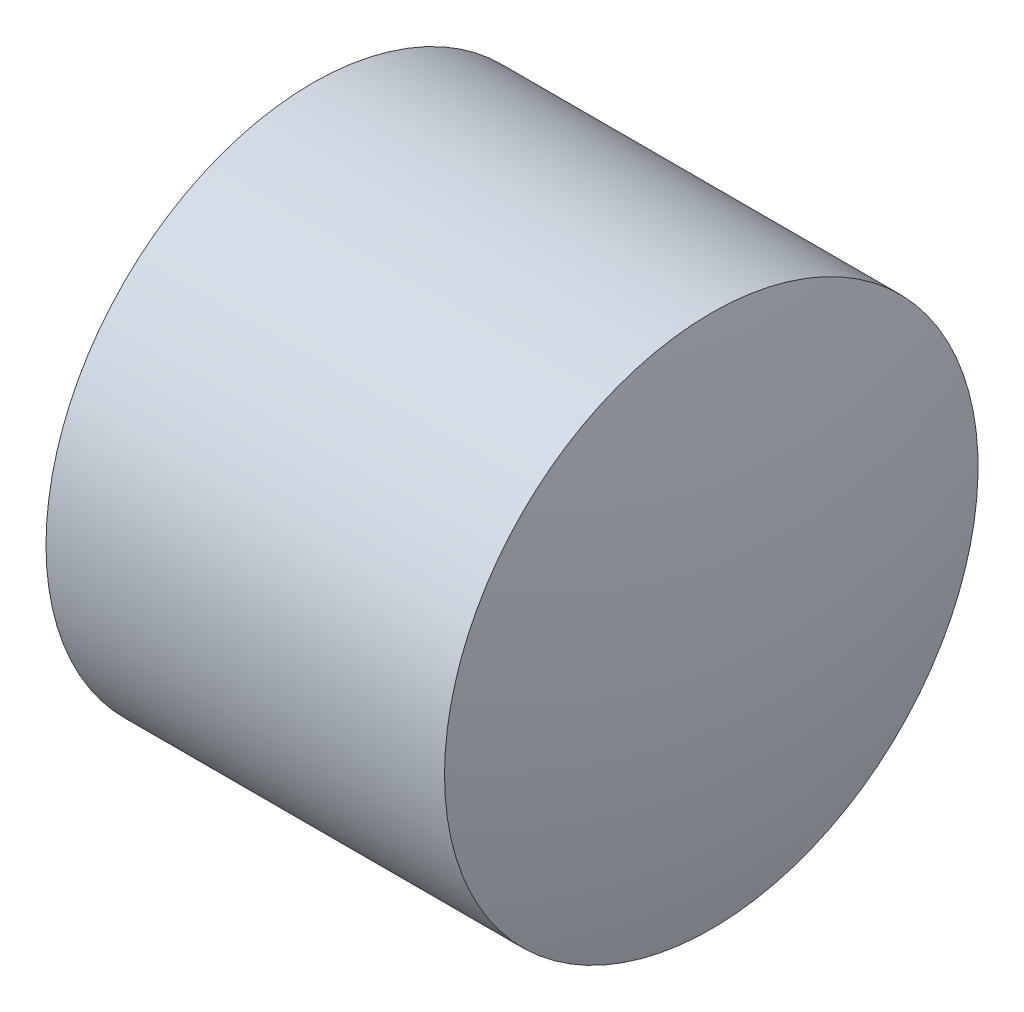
ISO-10303-21;
HEADER;
FILE_DESCRIPTION(('STEP AP214'),'2;1');
FILE_NAME('part.step','',(''),(''),'','','');
FILE_SCHEMA(('AUTOMOTIVE_DESIGN { 1 0 10303 214 1 1 1 1 }'));
ENDSEC;
DATA;
#1=APPLICATION_CONTEXT('core data for automotive mechanical design processes');
#2=APPLICATION_PROTOCOL_DEFINITION('international standard','automotive_design',2000,#1);
#3=PRODUCT_CONTEXT('',#1,'mechanical');
#4=PRODUCT('Part','Part','',(#3));
#5=PRODUCT_RELATED_PRODUCT_CATEGORY('part','',(#4));
#6=PRODUCT_DEFINITION_FORMATION('','',#4);
#7=PRODUCT_DEFINITION_CONTEXT('part definition',#1,'design');
#8=PRODUCT_DEFINITION('design','',#6,#7);
#9=PRODUCT_DEFINITION_SHAPE('','',#8);
#10=(LENGTH_UNIT() NAMED_UNIT(*) SI_UNIT(.MILLI.,.METRE.));
#11=(NAMED_UNIT(*) PLANE_ANGLE_UNIT() SI_UNIT($,.RADIAN.));
#12=(NAMED_UNIT(*) SI_UNIT($,.STERADIAN.) SOLID_ANGLE_UNIT());
#13=UNCERTAINTY_MEASURE_WITH_UNIT(LENGTH_MEASURE(1.E-05),#10,'distance_accuracy_value','');
#14=(GEOMETRIC_REPRESENTATION_CONTEXT(3) GLOBAL_UNCERTAINTY_ASSIGNED_CONTEXT((#13)) GLOBAL_UNIT_ASSIGNED_CONTEXT((#10,
#11,#12)) REPRESENTATION_CONTEXT('',''));
#15=CARTESIAN_POINT('',(0.,0.,0.));
#16=DIRECTION('',(0.,0.,1.));
#17=DIRECTION('',(1.,0.,0.));
#18=AXIS2_PLACEMENT_3D('',#15,#16,#17);
#19=CARTESIAN_POINT('',(24.8875,0.,8.));
#20=DIRECTION('',(-1.,0.,0.));
#21=DIRECTION('',(0.,1.,0.));
#22=AXIS2_PLACEMENT_3D('',#19,#20,#21);
#23=SPHERICAL_SURFACE('',#22,6.0525);
#24=CARTESIAN_POINT('',(19.3754444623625,0.,8.));
#25=DIRECTION('',(-1.,0.,0.));
#26=DIRECTION('',(0.,0.,1.));
#27=AXIS2_PLACEMENT_3D('',#24,#25,#26);
#28=CIRCLE('',#27,2.5);
#29=CARTESIAN_POINT('',(19.3754444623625,0.,10.5));
#30=VERTEX_POINT('',#29);
#31=EDGE_CURVE('E36',#30,#30,#28,.T.);
#32=ORIENTED_EDGE('',*,*,#31,.T.);
#33=EDGE_LOOP('',(#32));
#34=FACE_BOUND('',#33,.T.);
#35=ADVANCED_FACE('F30',(#34),#23,.T.);
#36=CARTESIAN_POINT('',(13.654,0.,8.));
#37=DIRECTION('',(-1.,0.,0.));
#38=DIRECTION('',(0.,1.,0.));
#39=AXIS2_PLACEMENT_3D('',#36,#37,#38);
#40=SPHERICAL_SURFACE('',#39,9.781);
#41=CARTESIAN_POINT('',(23.1101070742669,0.,8.));
#42=DIRECTION('',(-1.,0.,0.));
#43=DIRECTION('',(0.,0.,1.));
#44=AXIS2_PLACEMENT_3D('',#41,#42,#43);
#45=CIRCLE('',#44,2.5);
#46=CARTESIAN_POINT('',(23.1101070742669,0.,10.5));
#47=VERTEX_POINT('',#46);
#48=EDGE_CURVE('E10',#47,#47,#45,.T.);
#49=ORIENTED_EDGE('',*,*,#48,.F.);
#50=EDGE_LOOP('',(#49));
#51=FACE_BOUND('',#50,.T.);
#52=ADVANCED_FACE('F45',(#51),#40,.T.);
#53=CARTESIAN_POINT('',(0.,0.,8.));
#54=DIRECTION('',(-1.,0.,0.));
#55=DIRECTION('',(0.,0.,1.));
#56=AXIS2_PLACEMENT_3D('',#53,#54,#55);
#57=CYLINDRICAL_SURFACE('',#56,2.5);
#58=ORIENTED_EDGE('',*,*,#31,.F.);
#59=EDGE_LOOP('',(#58));
#60=FACE_BOUND('',#59,.T.);
#61=ORIENTED_EDGE('',*,*,#48,.T.);
#62=EDGE_LOOP('',(#61));
#63=FACE_BOUND('',#62,.T.);
#64=ADVANCED_FACE('F43',(#60,#63),#57,.T.);
#65=CLOSED_SHELL('',(#35,#52,#64));
#66=MANIFOLD_SOLID_BREP('B2',#65);
#67=ADVANCED_BREP_SHAPE_REPRESENTATION('',(#18,#66),#14);
#68=SHAPE_DEFINITION_REPRESENTATION(#9,#67);
ENDSEC;
END-ISO-10303-21;
